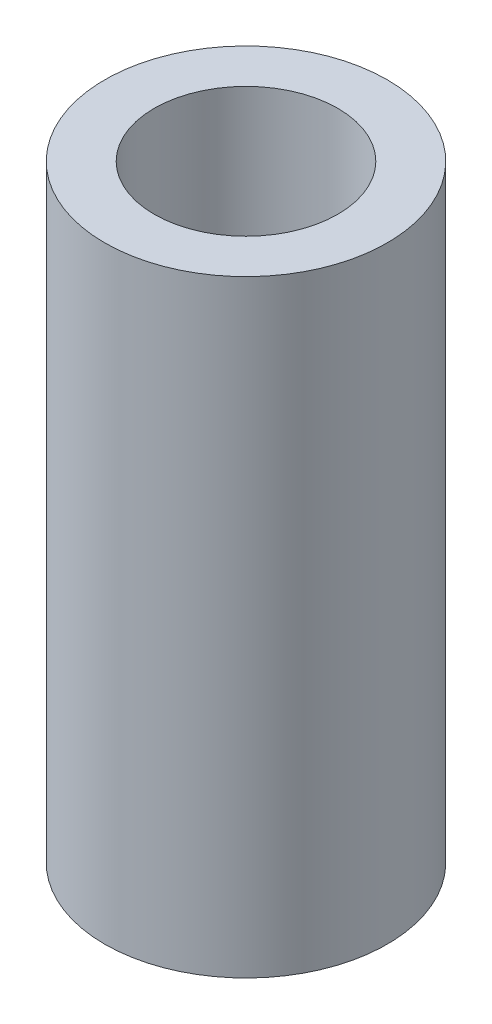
ISO-10303-21;
HEADER;
FILE_DESCRIPTION(('STEP AP214'),'2;1');
FILE_NAME('part.step','',(''),(''),'','','');
FILE_SCHEMA(('AUTOMOTIVE_DESIGN { 1 0 10303 214 1 1 1 1 }'));
ENDSEC;
DATA;
#1=APPLICATION_CONTEXT('core data for automotive mechanical design processes');
#2=APPLICATION_PROTOCOL_DEFINITION('international standard','automotive_design',2000,#1);
#3=PRODUCT_CONTEXT('',#1,'mechanical');
#4=PRODUCT('Part','Part','',(#3));
#5=PRODUCT_RELATED_PRODUCT_CATEGORY('part','',(#4));
#6=PRODUCT_DEFINITION_FORMATION('','',#4);
#7=PRODUCT_DEFINITION_CONTEXT('part definition',#1,'design');
#8=PRODUCT_DEFINITION('design','',#6,#7);
#9=PRODUCT_DEFINITION_SHAPE('','',#8);
#10=(LENGTH_UNIT() NAMED_UNIT(*) SI_UNIT(.MILLI.,.METRE.));
#11=(NAMED_UNIT(*) PLANE_ANGLE_UNIT() SI_UNIT($,.RADIAN.));
#12=(NAMED_UNIT(*) SI_UNIT($,.STERADIAN.) SOLID_ANGLE_UNIT());
#13=UNCERTAINTY_MEASURE_WITH_UNIT(LENGTH_MEASURE(1.E-05),#10,'distance_accuracy_value','');
#14=(GEOMETRIC_REPRESENTATION_CONTEXT(3) GLOBAL_UNCERTAINTY_ASSIGNED_CONTEXT((#13)) GLOBAL_UNIT_ASSIGNED_CONTEXT((#10,
#11,#12)) REPRESENTATION_CONTEXT('',''));
#15=CARTESIAN_POINT('',(0.,0.,0.));
#16=DIRECTION('',(0.,0.,1.));
#17=DIRECTION('',(1.,0.,0.));
#18=AXIS2_PLACEMENT_3D('',#15,#16,#17);
#19=CARTESIAN_POINT('',(0.,86.0000000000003,0.));
#20=DIRECTION('',(0.,-1.,0.));
#21=DIRECTION('',(0.,0.,-1.));
#22=AXIS2_PLACEMENT_3D('',#19,#20,#21);
#23=CYLINDRICAL_SURFACE('',#22,13.);
#24=CARTESIAN_POINT('',(0.,0.,0.));
#25=DIRECTION('',(0.,-1.,0.));
#26=DIRECTION('',(0.,0.,-1.));
#27=AXIS2_PLACEMENT_3D('',#24,#25,#26);
#28=CIRCLE('',#27,13.);
#29=CARTESIAN_POINT('',(0.,0.,-13.));
#30=VERTEX_POINT('',#29);
#31=EDGE_CURVE('E26',#30,#30,#28,.T.);
#32=ORIENTED_EDGE('',*,*,#31,.T.);
#33=EDGE_LOOP('',(#32));
#34=FACE_BOUND('',#33,.T.);
#35=CARTESIAN_POINT('',(0.,86.0000000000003,0.));
#36=DIRECTION('',(0.,-1.,0.));
#37=DIRECTION('',(0.,0.,-1.));
#38=AXIS2_PLACEMENT_3D('',#35,#36,#37);
#39=CIRCLE('',#38,13.);
#40=CARTESIAN_POINT('',(0.,86.0000000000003,-13.));
#41=VERTEX_POINT('',#40);
#42=EDGE_CURVE('E17',#41,#41,#39,.T.);
#43=ORIENTED_EDGE('',*,*,#42,.F.);
#44=EDGE_LOOP('',(#43));
#45=FACE_BOUND('',#44,.T.);
#46=ADVANCED_FACE('F14',(#34,#45),#23,.F.);
#47=CARTESIAN_POINT('',(0.,86.0000000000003,0.));
#48=DIRECTION('',(0.,1.,0.));
#49=DIRECTION('',(0.,0.,1.));
#50=AXIS2_PLACEMENT_3D('',#47,#48,#49);
#51=PLANE('',#50);
#52=ORIENTED_EDGE('',*,*,#42,.T.);
#53=EDGE_LOOP('',(#52));
#54=FACE_BOUND('',#53,.T.);
#55=CARTESIAN_POINT('',(0.,86.0000000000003,0.));
#56=DIRECTION('',(0.,-1.,0.));
#57=DIRECTION('',(0.,0.,-1.));
#58=AXIS2_PLACEMENT_3D('',#55,#56,#57);
#59=CIRCLE('',#58,20.);
#60=CARTESIAN_POINT('',(0.,86.0000000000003,-20.));
#61=VERTEX_POINT('',#60);
#62=EDGE_CURVE('E21',#61,#61,#59,.T.);
#63=ORIENTED_EDGE('',*,*,#62,.F.);
#64=EDGE_LOOP('',(#63));
#65=FACE_BOUND('',#64,.T.);
#66=ADVANCED_FACE('F34',(#54,#65),#51,.T.);
#67=CARTESIAN_POINT('',(0.,0.,0.));
#68=DIRECTION('',(0.,1.,0.));
#69=DIRECTION('',(0.,0.,1.));
#70=AXIS2_PLACEMENT_3D('',#67,#68,#69);
#71=PLANE('',#70);
#72=ORIENTED_EDGE('',*,*,#31,.F.);
#73=EDGE_LOOP('',(#72));
#74=FACE_BOUND('',#73,.T.);
#75=CARTESIAN_POINT('',(0.,0.,0.));
#76=DIRECTION('',(0.,-1.,0.));
#77=DIRECTION('',(0.,0.,-1.));
#78=AXIS2_PLACEMENT_3D('',#75,#76,#77);
#79=CIRCLE('',#78,20.);
#80=CARTESIAN_POINT('',(0.,0.,-20.));
#81=VERTEX_POINT('',#80);
#82=EDGE_CURVE('E10',#81,#81,#79,.F.);
#83=ORIENTED_EDGE('',*,*,#82,.F.);
#84=EDGE_LOOP('',(#83));
#85=FACE_BOUND('',#84,.T.);
#86=ADVANCED_FACE('F41',(#74,#85),#71,.F.);
#87=CARTESIAN_POINT('',(0.,86.0000000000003,0.));
#88=DIRECTION('',(0.,-1.,0.));
#89=DIRECTION('',(0.,0.,-1.));
#90=AXIS2_PLACEMENT_3D('',#87,#88,#89);
#91=CYLINDRICAL_SURFACE('',#90,20.);
#92=ORIENTED_EDGE('',*,*,#82,.T.);
#93=EDGE_LOOP('',(#92));
#94=FACE_BOUND('',#93,.T.);
#95=ORIENTED_EDGE('',*,*,#62,.T.);
#96=EDGE_LOOP('',(#95));
#97=FACE_BOUND('',#96,.T.);
#98=ADVANCED_FACE('F42',(#94,#97),#91,.T.);
#99=CLOSED_SHELL('',(#46,#66,#86,#98));
#100=MANIFOLD_SOLID_BREP('B1',#99);
#101=ADVANCED_BREP_SHAPE_REPRESENTATION('',(#18,#100),#14);
#102=SHAPE_DEFINITION_REPRESENTATION(#9,#101);
ENDSEC;
END-ISO-10303-21;
